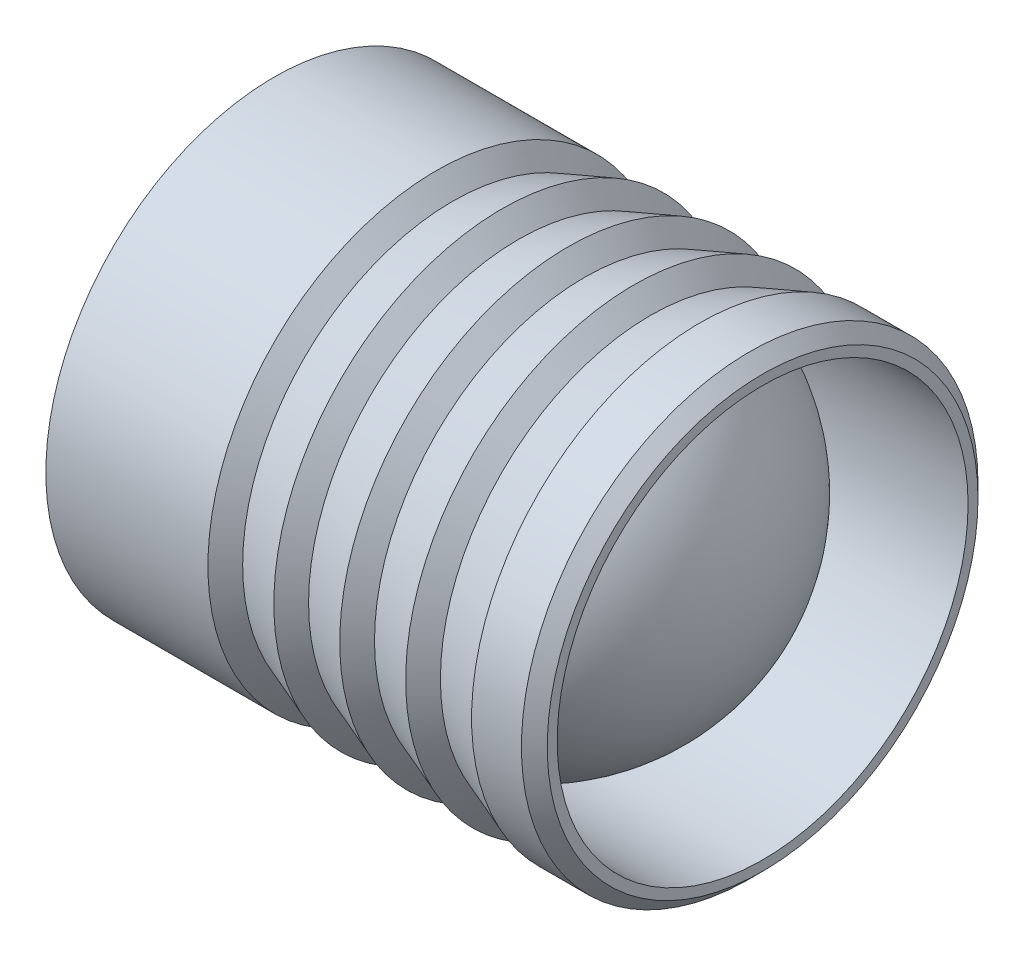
ISO-10303-21;
HEADER;
FILE_DESCRIPTION(('STEP AP214'),'2;1');
FILE_NAME('part.step','',(''),(''),'','','');
FILE_SCHEMA(('AUTOMOTIVE_DESIGN { 1 0 10303 214 1 1 1 1 }'));
ENDSEC;
DATA;
#1=APPLICATION_CONTEXT('core data for automotive mechanical design processes');
#2=APPLICATION_PROTOCOL_DEFINITION('international standard','automotive_design',2000,#1);
#3=PRODUCT_CONTEXT('',#1,'mechanical');
#4=PRODUCT('Part','Part','',(#3));
#5=PRODUCT_RELATED_PRODUCT_CATEGORY('part','',(#4));
#6=PRODUCT_DEFINITION_FORMATION('','',#4);
#7=PRODUCT_DEFINITION_CONTEXT('part definition',#1,'design');
#8=PRODUCT_DEFINITION('design','',#6,#7);
#9=PRODUCT_DEFINITION_SHAPE('','',#8);
#10=(LENGTH_UNIT() NAMED_UNIT(*) SI_UNIT(.MILLI.,.METRE.));
#11=(NAMED_UNIT(*) PLANE_ANGLE_UNIT() SI_UNIT($,.RADIAN.));
#12=(NAMED_UNIT(*) SI_UNIT($,.STERADIAN.) SOLID_ANGLE_UNIT());
#13=UNCERTAINTY_MEASURE_WITH_UNIT(LENGTH_MEASURE(1.E-05),#10,'distance_accuracy_value','');
#14=(GEOMETRIC_REPRESENTATION_CONTEXT(3) GLOBAL_UNCERTAINTY_ASSIGNED_CONTEXT((#13)) GLOBAL_UNIT_ASSIGNED_CONTEXT((#10,
#11,#12)) REPRESENTATION_CONTEXT('',''));
#15=CARTESIAN_POINT('',(0.,0.,0.));
#16=DIRECTION('',(0.,0.,1.));
#17=DIRECTION('',(1.,0.,0.));
#18=AXIS2_PLACEMENT_3D('',#15,#16,#17);
#19=CARTESIAN_POINT('',(6.09,0.,0.));
#20=DIRECTION('',(1.,0.,0.));
#21=DIRECTION('',(0.,1.,0.));
#22=AXIS2_PLACEMENT_3D('',#19,#20,#21);
#23=SPHERICAL_SURFACE('',#22,4.51);
#24=CARTESIAN_POINT('',(6.39016811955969,0.,0.));
#25=DIRECTION('',(-1.,0.,0.));
#26=DIRECTION('',(0.,0.,1.));
#27=AXIS2_PLACEMENT_3D('',#24,#25,#26);
#28=CIRCLE('',#27,4.4999999);
#29=CARTESIAN_POINT('',(6.39016811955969,0.,4.4999999));
#30=VERTEX_POINT('',#29);
#31=EDGE_CURVE('E41',#30,#30,#28,.T.);
#32=ORIENTED_EDGE('',*,*,#31,.F.);
#33=EDGE_LOOP('',(#32));
#34=FACE_BOUND('',#33,.T.);
#35=CARTESIAN_POINT('',(10.6,0.,0.));
#36=VERTEX_POINT('',#35);
#37=VERTEX_LOOP('',#36);
#38=FACE_BOUND('',#37,.T.);
#39=ADVANCED_FACE('F18',(#34,#38),#23,.T.);
#40=CARTESIAN_POINT('',(11.,4.71715728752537,0.));
#41=DIRECTION('',(-1.,0.,0.));
#42=DIRECTION('',(0.,0.,1.));
#43=AXIS2_PLACEMENT_3D('',#40,#41,#42);
#44=PLANE('',#43);
#45=CARTESIAN_POINT('',(11.,0.,0.));
#46=DIRECTION('',(1.,0.,0.));
#47=DIRECTION('',(0.,0.,-1.));
#48=AXIS2_PLACEMENT_3D('',#45,#46,#47);
#49=CIRCLE('',#48,4.7171572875);
#50=CARTESIAN_POINT('',(11.,0.,-4.71715728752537));
#51=VERTEX_POINT('',#50);
#52=EDGE_CURVE('E11',#51,#51,#49,.T.);
#53=ORIENTED_EDGE('',*,*,#52,.T.);
#54=EDGE_LOOP('',(#53));
#55=FACE_BOUND('',#54,.T.);
#56=CARTESIAN_POINT('',(11.,0.,0.));
#57=DIRECTION('',(1.,0.,0.));
#58=DIRECTION('',(0.,0.,-1.));
#59=AXIS2_PLACEMENT_3D('',#56,#57,#58);
#60=CIRCLE('',#59,4.4999999);
#61=CARTESIAN_POINT('',(11.,0.,-4.4999999));
#62=VERTEX_POINT('',#61);
#63=EDGE_CURVE('E29',#62,#62,#60,.T.);
#64=ORIENTED_EDGE('',*,*,#63,.F.);
#65=EDGE_LOOP('',(#64));
#66=FACE_BOUND('',#65,.T.);
#67=ADVANCED_FACE('F174',(#55,#66),#44,.F.);
#68=CARTESIAN_POINT('',(11.,0.,0.));
#69=DIRECTION('',(-1.,0.,0.));
#70=DIRECTION('',(0.,0.,-1.));
#71=AXIS2_PLACEMENT_3D('',#68,#69,#70);
#72=CYLINDRICAL_SURFACE('',#71,4.4999999);
#73=ORIENTED_EDGE('',*,*,#63,.T.);
#74=EDGE_LOOP('',(#73));
#75=FACE_BOUND('',#74,.T.);
#76=ORIENTED_EDGE('',*,*,#31,.T.);
#77=EDGE_LOOP('',(#76));
#78=FACE_BOUND('',#77,.T.);
#79=ADVANCED_FACE('F171',(#75,#78),#72,.F.);
#80=CARTESIAN_POINT('',(0.,0.,0.));
#81=DIRECTION('',(1.,0.,0.));
#82=DIRECTION('',(0.,1.,0.));
#83=AXIS2_PLACEMENT_3D('',#80,#81,#82);
#84=PLANE('',#83);
#85=CARTESIAN_POINT('',(0.,0.,0.));
#86=DIRECTION('',(1.,0.,0.));
#87=DIRECTION('',(0.,0.,-1.));
#88=AXIS2_PLACEMENT_3D('',#85,#86,#87);
#89=CIRCLE('',#88,4.4803847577);
#90=CARTESIAN_POINT('',(0.,0.,-4.48038475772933));
#91=VERTEX_POINT('',#90);
#92=EDGE_CURVE('E114',#91,#91,#89,.T.);
#93=ORIENTED_EDGE('',*,*,#92,.F.);
#94=EDGE_LOOP('',(#93));
#95=FACE_BOUND('',#94,.T.);
#96=ADVANCED_FACE('F183',(#95),#84,.F.);
#97=CARTESIAN_POINT('',(10.7171572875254,0.,0.));
#98=DIRECTION('',(-1.,0.,0.));
#99=DIRECTION('',(0.,0.,1.));
#100=AXIS2_PLACEMENT_3D('',#97,#98,#99);
#101=CONICAL_SURFACE('',#100,5.,0.7853981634);
#102=CARTESIAN_POINT('',(10.7171572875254,0.,0.));
#103=DIRECTION('',(1.,0.,0.));
#104=DIRECTION('',(0.,0.,-1.));
#105=AXIS2_PLACEMENT_3D('',#102,#103,#104);
#106=CIRCLE('',#105,5.);
#107=CARTESIAN_POINT('',(10.7171572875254,0.,-5.));
#108=VERTEX_POINT('',#107);
#109=EDGE_CURVE('E138',#108,#108,#106,.T.);
#110=ORIENTED_EDGE('',*,*,#109,.T.);
#111=EDGE_LOOP('',(#110));
#112=FACE_BOUND('',#111,.T.);
#113=ORIENTED_EDGE('',*,*,#52,.F.);
#114=EDGE_LOOP('',(#113));
#115=FACE_BOUND('',#114,.T.);
#116=ADVANCED_FACE('F188',(#112,#115),#101,.T.);
#117=CARTESIAN_POINT('',(11.,0.,0.));
#118=DIRECTION('',(-1.,0.,0.));
#119=DIRECTION('',(0.,0.,-1.));
#120=AXIS2_PLACEMENT_3D('',#117,#118,#119);
#121=CYLINDRICAL_SURFACE('',#120,5.);
#122=CARTESIAN_POINT('',(9.625,0.,0.));
#123=DIRECTION('',(1.,0.,0.));
#124=DIRECTION('',(0.,0.,-1.));
#125=AXIS2_PLACEMENT_3D('',#122,#123,#124);
#126=CIRCLE('',#125,5.);
#127=CARTESIAN_POINT('',(9.625,0.,-5.));
#128=VERTEX_POINT('',#127);
#129=EDGE_CURVE('E130',#128,#128,#126,.T.);
#130=ORIENTED_EDGE('',*,*,#129,.T.);
#131=EDGE_LOOP('',(#130));
#132=FACE_BOUND('',#131,.T.);
#133=ORIENTED_EDGE('',*,*,#109,.F.);
#134=EDGE_LOOP('',(#133));
#135=FACE_BOUND('',#134,.T.);
#136=ADVANCED_FACE('F191',(#132,#135),#121,.T.);
#137=CARTESIAN_POINT('',(8.5421875,0.,0.));
#138=DIRECTION('',(1.,0.,0.));
#139=DIRECTION('',(0.,0.,-1.));
#140=AXIS2_PLACEMENT_3D('',#137,#138,#139);
#141=CONICAL_SURFACE('',#140,4.6,0.3538594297);
#142=ORIENTED_EDGE('',*,*,#129,.F.);
#143=EDGE_LOOP('',(#142));
#144=FACE_BOUND('',#143,.T.);
#145=CARTESIAN_POINT('',(8.5421875,0.,0.));
#146=DIRECTION('',(1.,0.,0.));
#147=DIRECTION('',(0.,0.,-1.));
#148=AXIS2_PLACEMENT_3D('',#145,#146,#147);
#149=CIRCLE('',#148,4.6);
#150=CARTESIAN_POINT('',(8.5421875,0.,-4.6));
#151=VERTEX_POINT('',#150);
#152=EDGE_CURVE('E127',#151,#151,#149,.T.);
#153=ORIENTED_EDGE('',*,*,#152,.T.);
#154=EDGE_LOOP('',(#153));
#155=FACE_BOUND('',#154,.T.);
#156=ADVANCED_FACE('F216',(#144,#155),#141,.T.);
#157=CARTESIAN_POINT('',(8.18125,0.,0.));
#158=DIRECTION('',(-1.,0.,0.));
#159=DIRECTION('',(0.,0.,1.));
#160=AXIS2_PLACEMENT_3D('',#157,#158,#159);
#161=CONICAL_SURFACE('',#160,5.,0.8366878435);
#162=CARTESIAN_POINT('',(8.18125,0.,0.));
#163=DIRECTION('',(1.,0.,0.));
#164=DIRECTION('',(0.,0.,-1.));
#165=AXIS2_PLACEMENT_3D('',#162,#163,#164);
#166=CIRCLE('',#165,5.);
#167=CARTESIAN_POINT('',(8.18125,0.,-5.));
#168=VERTEX_POINT('',#167);
#169=EDGE_CURVE('E131',#168,#168,#166,.T.);
#170=ORIENTED_EDGE('',*,*,#169,.T.);
#171=EDGE_LOOP('',(#170));
#172=FACE_BOUND('',#171,.T.);
#173=ORIENTED_EDGE('',*,*,#152,.F.);
#174=EDGE_LOOP('',(#173));
#175=FACE_BOUND('',#174,.T.);
#176=ADVANCED_FACE('F212',(#172,#175),#161,.T.);
#177=CARTESIAN_POINT('',(7.0984375,0.,0.));
#178=DIRECTION('',(1.,0.,0.));
#179=DIRECTION('',(0.,0.,-1.));
#180=AXIS2_PLACEMENT_3D('',#177,#178,#179);
#181=CONICAL_SURFACE('',#180,4.6,0.3538594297);
#182=ORIENTED_EDGE('',*,*,#169,.F.);
#183=EDGE_LOOP('',(#182));
#184=FACE_BOUND('',#183,.T.);
#185=CARTESIAN_POINT('',(7.0984375,0.,0.));
#186=DIRECTION('',(1.,0.,0.));
#187=DIRECTION('',(0.,0.,-1.));
#188=AXIS2_PLACEMENT_3D('',#185,#186,#187);
#189=CIRCLE('',#188,4.6);
#190=CARTESIAN_POINT('',(7.0984375,0.,-4.6));
#191=VERTEX_POINT('',#190);
#192=EDGE_CURVE('E135',#191,#191,#189,.T.);
#193=ORIENTED_EDGE('',*,*,#192,.T.);
#194=EDGE_LOOP('',(#193));
#195=FACE_BOUND('',#194,.T.);
#196=ADVANCED_FACE('F215',(#184,#195),#181,.T.);
#197=CARTESIAN_POINT('',(6.7375,0.,0.));
#198=DIRECTION('',(-1.,0.,0.));
#199=DIRECTION('',(0.,0.,1.));
#200=AXIS2_PLACEMENT_3D('',#197,#198,#199);
#201=CONICAL_SURFACE('',#200,5.,0.8366878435);
#202=CARTESIAN_POINT('',(6.7375,0.,0.));
#203=DIRECTION('',(1.,0.,0.));
#204=DIRECTION('',(0.,0.,-1.));
#205=AXIS2_PLACEMENT_3D('',#202,#203,#204);
#206=CIRCLE('',#205,5.);
#207=CARTESIAN_POINT('',(6.7375,0.,-5.));
#208=VERTEX_POINT('',#207);
#209=EDGE_CURVE('E132',#208,#208,#206,.T.);
#210=ORIENTED_EDGE('',*,*,#209,.T.);
#211=EDGE_LOOP('',(#210));
#212=FACE_BOUND('',#211,.T.);
#213=ORIENTED_EDGE('',*,*,#192,.F.);
#214=EDGE_LOOP('',(#213));
#215=FACE_BOUND('',#214,.T.);
#216=ADVANCED_FACE('F270',(#212,#215),#201,.T.);
#217=CARTESIAN_POINT('',(5.6546875,0.,0.));
#218=DIRECTION('',(1.,0.,0.));
#219=DIRECTION('',(0.,0.,-1.));
#220=AXIS2_PLACEMENT_3D('',#217,#218,#219);
#221=CONICAL_SURFACE('',#220,4.6,0.3538594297);
#222=ORIENTED_EDGE('',*,*,#209,.F.);
#223=EDGE_LOOP('',(#222));
#224=FACE_BOUND('',#223,.T.);
#225=CARTESIAN_POINT('',(5.6546875,0.,0.));
#226=DIRECTION('',(1.,0.,0.));
#227=DIRECTION('',(0.,0.,-1.));
#228=AXIS2_PLACEMENT_3D('',#225,#226,#227);
#229=CIRCLE('',#228,4.6);
#230=CARTESIAN_POINT('',(5.6546875,0.,-4.6));
#231=VERTEX_POINT('',#230);
#232=EDGE_CURVE('E136',#231,#231,#229,.T.);
#233=ORIENTED_EDGE('',*,*,#232,.T.);
#234=EDGE_LOOP('',(#233));
#235=FACE_BOUND('',#234,.T.);
#236=ADVANCED_FACE('F201',(#224,#235),#221,.T.);
#237=CARTESIAN_POINT('',(5.29375,0.,0.));
#238=DIRECTION('',(-1.,0.,0.));
#239=DIRECTION('',(0.,0.,1.));
#240=AXIS2_PLACEMENT_3D('',#237,#238,#239);
#241=CONICAL_SURFACE('',#240,5.,0.8366878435);
#242=CARTESIAN_POINT('',(5.29375,0.,0.));
#243=DIRECTION('',(1.,0.,0.));
#244=DIRECTION('',(0.,0.,-1.));
#245=AXIS2_PLACEMENT_3D('',#242,#243,#244);
#246=CIRCLE('',#245,5.);
#247=CARTESIAN_POINT('',(5.29375,0.,-5.));
#248=VERTEX_POINT('',#247);
#249=EDGE_CURVE('E142',#248,#248,#246,.T.);
#250=ORIENTED_EDGE('',*,*,#249,.T.);
#251=EDGE_LOOP('',(#250));
#252=FACE_BOUND('',#251,.T.);
#253=ORIENTED_EDGE('',*,*,#232,.F.);
#254=EDGE_LOOP('',(#253));
#255=FACE_BOUND('',#254,.T.);
#256=ADVANCED_FACE('F197',(#252,#255),#241,.T.);
#257=CARTESIAN_POINT('',(4.2109375,0.,0.));
#258=DIRECTION('',(1.,0.,0.));
#259=DIRECTION('',(0.,0.,-1.));
#260=AXIS2_PLACEMENT_3D('',#257,#258,#259);
#261=CONICAL_SURFACE('',#260,4.6,0.3538594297);
#262=ORIENTED_EDGE('',*,*,#249,.F.);
#263=EDGE_LOOP('',(#262));
#264=FACE_BOUND('',#263,.T.);
#265=CARTESIAN_POINT('',(4.2109375,0.,0.));
#266=DIRECTION('',(1.,0.,0.));
#267=DIRECTION('',(0.,0.,-1.));
#268=AXIS2_PLACEMENT_3D('',#265,#266,#267);
#269=CIRCLE('',#268,4.6);
#270=CARTESIAN_POINT('',(4.2109375,0.,-4.6));
#271=VERTEX_POINT('',#270);
#272=EDGE_CURVE('E22',#271,#271,#269,.T.);
#273=ORIENTED_EDGE('',*,*,#272,.T.);
#274=EDGE_LOOP('',(#273));
#275=FACE_BOUND('',#274,.T.);
#276=ADVANCED_FACE('F200',(#264,#275),#261,.T.);
#277=CARTESIAN_POINT('',(3.85,0.,0.));
#278=DIRECTION('',(-1.,0.,0.));
#279=DIRECTION('',(0.,0.,1.));
#280=AXIS2_PLACEMENT_3D('',#277,#278,#279);
#281=CONICAL_SURFACE('',#280,5.,0.8366878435);
#282=CARTESIAN_POINT('',(3.85,0.,0.));
#283=DIRECTION('',(1.,0.,0.));
#284=DIRECTION('',(0.,0.,-1.));
#285=AXIS2_PLACEMENT_3D('',#282,#283,#284);
#286=CIRCLE('',#285,5.);
#287=CARTESIAN_POINT('',(3.85,0.,-5.));
#288=VERTEX_POINT('',#287);
#289=EDGE_CURVE('E146',#288,#288,#286,.T.);
#290=ORIENTED_EDGE('',*,*,#289,.T.);
#291=EDGE_LOOP('',(#290));
#292=FACE_BOUND('',#291,.T.);
#293=ORIENTED_EDGE('',*,*,#272,.F.);
#294=EDGE_LOOP('',(#293));
#295=FACE_BOUND('',#294,.T.);
#296=ADVANCED_FACE('F205',(#292,#295),#281,.T.);
#297=CARTESIAN_POINT('',(11.,0.,0.));
#298=DIRECTION('',(-1.,0.,0.));
#299=DIRECTION('',(0.,0.,-1.));
#300=AXIS2_PLACEMENT_3D('',#297,#298,#299);
#301=CYLINDRICAL_SURFACE('',#300,5.);
#302=CARTESIAN_POINT('',(0.3,0.,0.));
#303=DIRECTION('',(1.,0.,0.));
#304=DIRECTION('',(0.,0.,-1.));
#305=AXIS2_PLACEMENT_3D('',#302,#303,#304);
#306=CIRCLE('',#305,5.);
#307=CARTESIAN_POINT('',(0.3,0.,-5.));
#308=VERTEX_POINT('',#307);
#309=EDGE_CURVE('E121',#308,#308,#306,.T.);
#310=ORIENTED_EDGE('',*,*,#309,.T.);
#311=EDGE_LOOP('',(#310));
#312=FACE_BOUND('',#311,.T.);
#313=ORIENTED_EDGE('',*,*,#289,.F.);
#314=EDGE_LOOP('',(#313));
#315=FACE_BOUND('',#314,.T.);
#316=ADVANCED_FACE('F210',(#312,#315),#301,.T.);
#317=CARTESIAN_POINT('',(0.,0.,0.));
#318=DIRECTION('',(1.,0.,0.));
#319=DIRECTION('',(0.,0.,-1.));
#320=AXIS2_PLACEMENT_3D('',#317,#318,#319);
#321=CONICAL_SURFACE('',#320,4.4803847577,1.0471975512);
#322=ORIENTED_EDGE('',*,*,#309,.F.);
#323=EDGE_LOOP('',(#322));
#324=FACE_BOUND('',#323,.T.);
#325=ORIENTED_EDGE('',*,*,#92,.T.);
#326=EDGE_LOOP('',(#325));
#327=FACE_BOUND('',#326,.T.);
#328=ADVANCED_FACE('F207',(#324,#327),#321,.T.);
#329=CLOSED_SHELL('',(#39,#67,#79,#96,#116,#136,#156,#176,#196,#216,#236,#256,#276,#296,#316,#328));
#330=CARTESIAN_POINT('',(3.14807615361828,0.,0.));
#331=DIRECTION('',(1.,0.,0.));
#332=DIRECTION('',(0.,0.,-1.));
#333=AXIS2_PLACEMENT_3D('',#330,#331,#332);
#334=CONICAL_SURFACE('',#333,4.4999999,1.0471975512);
#335=CARTESIAN_POINT('',(3.14807615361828,0.,0.));
#336=DIRECTION('',(1.,0.,0.));
#337=DIRECTION('',(0.,0.,-1.));
#338=AXIS2_PLACEMENT_3D('',#335,#336,#337);
#339=CIRCLE('',#338,4.4999999);
#340=CARTESIAN_POINT('',(3.14807615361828,0.,-4.4999999));
#341=VERTEX_POINT('',#340);
#342=EDGE_CURVE('E110',#341,#341,#339,.T.);
#343=ORIENTED_EDGE('',*,*,#342,.T.);
#344=EDGE_LOOP('',(#343));
#345=FACE_BOUND('',#344,.T.);
#346=CARTESIAN_POINT('',(0.55,0.,0.));
#347=VERTEX_POINT('',#346);
#348=VERTEX_LOOP('',#347);
#349=FACE_BOUND('',#348,.T.);
#350=ADVANCED_FACE('F193',(#345,#349),#334,.F.);
#351=CARTESIAN_POINT('',(6.09,0.,0.));
#352=DIRECTION('',(1.,0.,0.));
#353=DIRECTION('',(0.,1.,0.));
#354=AXIS2_PLACEMENT_3D('',#351,#352,#353);
#355=SPHERICAL_SURFACE('',#354,4.51);
#356=CARTESIAN_POINT('',(5.78983188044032,0.,0.));
#357=DIRECTION('',(1.,0.,0.));
#358=DIRECTION('',(0.,0.,-1.));
#359=AXIS2_PLACEMENT_3D('',#356,#357,#358);
#360=CIRCLE('',#359,4.4999999);
#361=CARTESIAN_POINT('',(5.78983188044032,0.,-4.4999999));
#362=VERTEX_POINT('',#361);
#363=EDGE_CURVE('E115',#362,#362,#360,.T.);
#364=ORIENTED_EDGE('',*,*,#363,.F.);
#365=EDGE_LOOP('',(#364));
#366=FACE_BOUND('',#365,.T.);
#367=CARTESIAN_POINT('',(1.58,0.,0.));
#368=VERTEX_POINT('',#367);
#369=VERTEX_LOOP('',#368);
#370=FACE_BOUND('',#369,.T.);
#371=ADVANCED_FACE('F20',(#366,#370),#355,.T.);
#372=CARTESIAN_POINT('',(11.,0.,0.));
#373=DIRECTION('',(-1.,0.,0.));
#374=DIRECTION('',(0.,0.,-1.));
#375=AXIS2_PLACEMENT_3D('',#372,#373,#374);
#376=CYLINDRICAL_SURFACE('',#375,4.4999999);
#377=ORIENTED_EDGE('',*,*,#363,.T.);
#378=EDGE_LOOP('',(#377));
#379=FACE_BOUND('',#378,.T.);
#380=ORIENTED_EDGE('',*,*,#342,.F.);
#381=EDGE_LOOP('',(#380));
#382=FACE_BOUND('',#381,.T.);
#383=ADVANCED_FACE('F111',(#379,#382),#376,.F.);
#384=CLOSED_SHELL('',(#350,#371,#383));
#385=ORIENTED_CLOSED_SHELL('',*,#384,.T.);
#386=BREP_WITH_VOIDS('B1',#329,(#385));
#387=ADVANCED_BREP_SHAPE_REPRESENTATION('',(#18,#386),#14);
#388=SHAPE_DEFINITION_REPRESENTATION(#9,#387);
ENDSEC;
END-ISO-10303-21;
